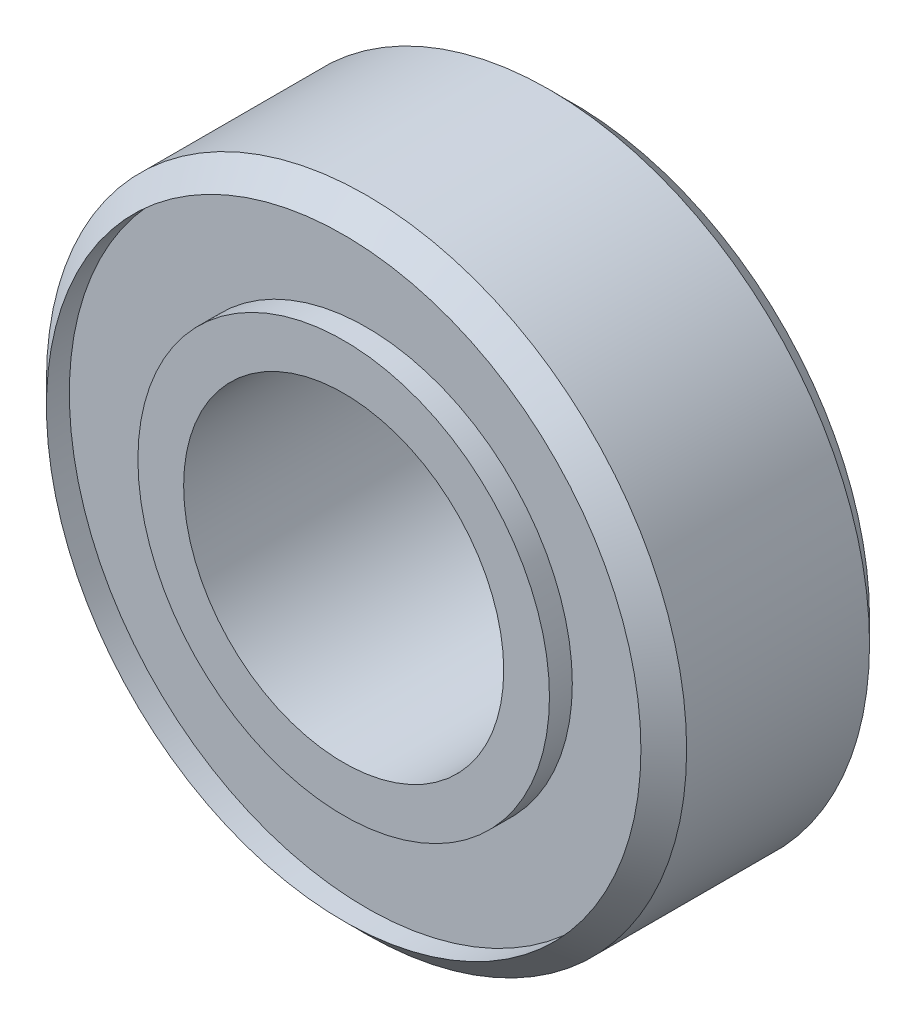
from build123d import *

# Parameters (mm, degrees)
ESQUISSE1_R             = 7
ESQUISSE1_R_2           = 3.5
BASE_EXTRUSION_DEPTH    = 5
CHANFREIN1_SIZE         = 0.5
ESQUISSE2_R             = 6.5
ESQUISSE2_R_2           = 4.5
ENL_V_MAT_EXTRU_1_DEPTH = 0.5
ENL_V_START             = -0.5
ESQUISSE3_R             = 6.5
ESQUISSE3_R_2           = 4.5
ENL_V_MAT_EXTRU_2_DEPTH = 0.5


with BuildPart() as part:
    # Esquisse1 → Base-Extrusion (new body)
    with BuildSketch(Plane.XY):
        Circle(ESQUISSE1_R)
        Circle(ESQUISSE1_R_2, mode=Mode.SUBTRACT)
    extrude(amount=BASE_EXTRUSION_DEPTH)

    # Chanfrein1
    chanfrein1_edges = [part.edges().sort_by_distance(p)[0] for p in [
        (-7, 0, 0),
        (-7, 0, 5),
    ]]
    chamfer(chanfrein1_edges, length=CHANFREIN1_SIZE)

    # Esquisse2 → Enl_v. mat.-Extru.1 (cut)
    with BuildSketch(Plane.XY.offset(5)):
        Circle(ESQUISSE2_R)
        Circle(ESQUISSE2_R_2, mode=Mode.SUBTRACT)
    extrude(amount=-ENL_V_MAT_EXTRU_1_DEPTH, mode=Mode.SUBTRACT)

    # Esquisse3 → Enl_v. mat.-Extru.2 (cut)
    with BuildSketch(Plane(origin=(0, 0, 0), x_dir=(-1, 0, 0), z_dir=(0, 0, -1)).offset(ENL_V_START)):
        with Locations(Location((0, 0, 0), (0, 0, 180))):
            Circle(ESQUISSE3_R)
        with Locations(Location((0, 0, 0), (0, 0, 180))):
            Circle(ESQUISSE3_R_2, mode=Mode.SUBTRACT)
    extrude(amount=ENL_V_MAT_EXTRU_2_DEPTH, mode=Mode.SUBTRACT)


solid = part.part
